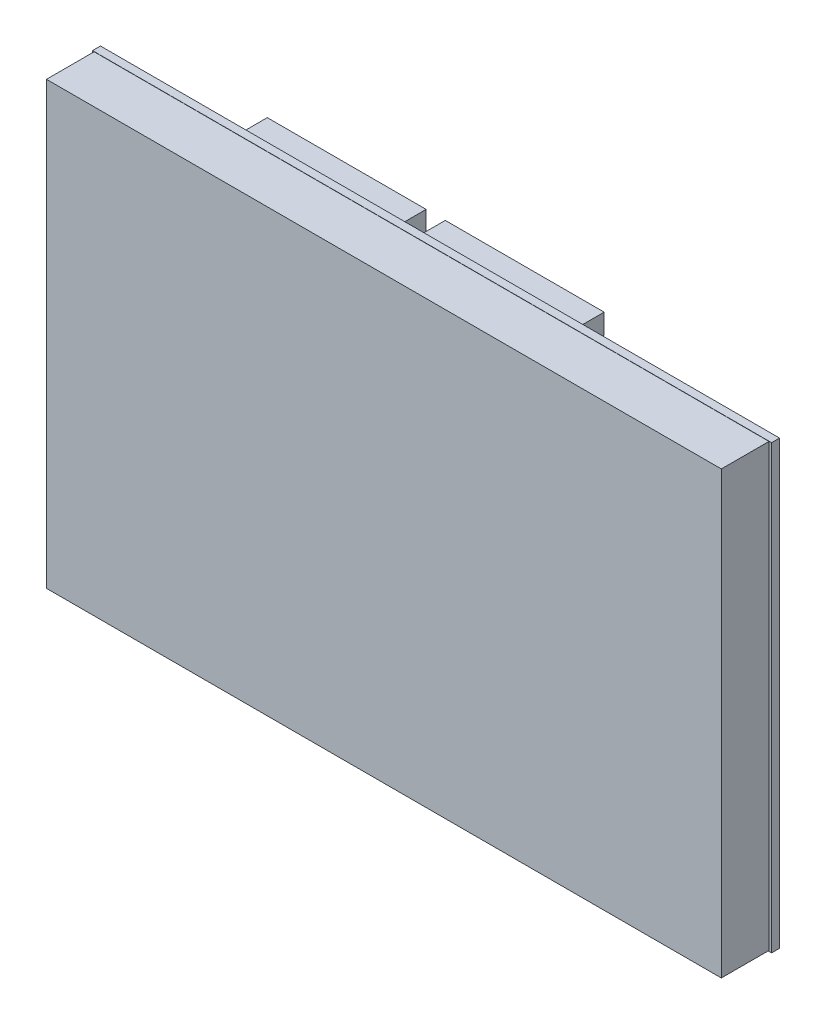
ISO-10303-21;
HEADER;
FILE_DESCRIPTION(('STEP AP214'),'2;1');
FILE_NAME('part.step','',(''),(''),'','','');
FILE_SCHEMA(('AUTOMOTIVE_DESIGN { 1 0 10303 214 1 1 1 1 }'));
ENDSEC;
DATA;
#1=APPLICATION_CONTEXT('core data for automotive mechanical design processes');
#2=APPLICATION_PROTOCOL_DEFINITION('international standard','automotive_design',2000,#1);
#3=PRODUCT_CONTEXT('',#1,'mechanical');
#4=PRODUCT('Part','Part','',(#3));
#5=PRODUCT_RELATED_PRODUCT_CATEGORY('part','',(#4));
#6=PRODUCT_DEFINITION_FORMATION('','',#4);
#7=PRODUCT_DEFINITION_CONTEXT('part definition',#1,'design');
#8=PRODUCT_DEFINITION('design','',#6,#7);
#9=PRODUCT_DEFINITION_SHAPE('','',#8);
#10=(LENGTH_UNIT() NAMED_UNIT(*) SI_UNIT(.MILLI.,.METRE.));
#11=(NAMED_UNIT(*) PLANE_ANGLE_UNIT() SI_UNIT($,.RADIAN.));
#12=(NAMED_UNIT(*) SI_UNIT($,.STERADIAN.) SOLID_ANGLE_UNIT());
#13=UNCERTAINTY_MEASURE_WITH_UNIT(LENGTH_MEASURE(1.E-05),#10,'distance_accuracy_value','');
#14=(GEOMETRIC_REPRESENTATION_CONTEXT(3) GLOBAL_UNCERTAINTY_ASSIGNED_CONTEXT((#13)) GLOBAL_UNIT_ASSIGNED_CONTEXT((#10,
#11,#12)) REPRESENTATION_CONTEXT('',''));
#15=CARTESIAN_POINT('',(0.,0.,0.));
#16=DIRECTION('',(0.,0.,1.));
#17=DIRECTION('',(1.,0.,0.));
#18=AXIS2_PLACEMENT_3D('',#15,#16,#17);
#19=CARTESIAN_POINT('',(-42.545,27.785,6.));
#20=DIRECTION('',(1.,0.,0.));
#21=DIRECTION('',(0.,1.,0.));
#22=AXIS2_PLACEMENT_3D('',#19,#20,#21);
#23=PLANE('',#22);
#24=DIRECTION('',(0.,-1.,0.));
#25=VECTOR('',#24,1.);
#26=CARTESIAN_POINT('',(-42.545,27.785,0.));
#27=LINE('',#26,#25);
#28=CARTESIAN_POINT('',(-42.545,27.785,0.));
#29=VERTEX_POINT('',#28);
#30=CARTESIAN_POINT('',(-42.5449999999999,-27.715,0.));
#31=VERTEX_POINT('',#30);
#32=EDGE_CURVE('E109',#29,#31,#27,.T.);
#33=ORIENTED_EDGE('',*,*,#32,.T.);
#34=DIRECTION('',(0.,0.,-1.));
#35=VECTOR('',#34,1.);
#36=CARTESIAN_POINT('',(-42.5449999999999,-27.715,6.));
#37=LINE('',#36,#35);
#38=CARTESIAN_POINT('',(-42.5449999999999,-27.715,6.));
#39=VERTEX_POINT('',#38);
#40=EDGE_CURVE('E12',#39,#31,#37,.T.);
#41=ORIENTED_EDGE('',*,*,#40,.F.);
#42=DIRECTION('',(0.,-1.,0.));
#43=VECTOR('',#42,1.);
#44=CARTESIAN_POINT('',(-42.545,27.785,6.));
#45=LINE('',#44,#43);
#46=CARTESIAN_POINT('',(-42.545,27.785,6.));
#47=VERTEX_POINT('',#46);
#48=EDGE_CURVE('E97',#47,#39,#45,.T.);
#49=ORIENTED_EDGE('',*,*,#48,.F.);
#50=DIRECTION('',(0.,0.,-1.));
#51=VECTOR('',#50,1.);
#52=CARTESIAN_POINT('',(-42.545,27.785,6.));
#53=LINE('',#52,#51);
#54=EDGE_CURVE('E105',#47,#29,#53,.T.);
#55=ORIENTED_EDGE('',*,*,#54,.T.);
#56=EDGE_LOOP('',(#33,#41,#49,#55));
#57=FACE_BOUND('',#56,.T.);
#58=ADVANCED_FACE('F46',(#57),#23,.F.);
#59=CARTESIAN_POINT('',(-42.5449999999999,-27.715,6.));
#60=DIRECTION('',(0.,1.,0.));
#61=DIRECTION('',(-1.,0.,0.));
#62=AXIS2_PLACEMENT_3D('',#59,#60,#61);
#63=PLANE('',#62);
#64=DIRECTION('',(1.,0.,0.));
#65=VECTOR('',#64,1.);
#66=CARTESIAN_POINT('',(-42.5449999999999,-27.715,0.));
#67=LINE('',#66,#65);
#68=CARTESIAN_POINT('',(42.4150000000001,-27.715,0.));
#69=VERTEX_POINT('',#68);
#70=EDGE_CURVE('E101',#31,#69,#67,.T.);
#71=ORIENTED_EDGE('',*,*,#70,.T.);
#72=DIRECTION('',(0.,0.,-1.));
#73=VECTOR('',#72,1.);
#74=CARTESIAN_POINT('',(42.4150000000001,-27.715,6.));
#75=LINE('',#74,#73);
#76=CARTESIAN_POINT('',(42.4150000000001,-27.715,6.));
#77=VERTEX_POINT('',#76);
#78=EDGE_CURVE('E54',#77,#69,#75,.T.);
#79=ORIENTED_EDGE('',*,*,#78,.F.);
#80=DIRECTION('',(1.,0.,0.));
#81=VECTOR('',#80,1.);
#82=CARTESIAN_POINT('',(-42.5449999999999,-27.715,6.));
#83=LINE('',#82,#81);
#84=EDGE_CURVE('E92',#39,#77,#83,.T.);
#85=ORIENTED_EDGE('',*,*,#84,.F.);
#86=ORIENTED_EDGE('',*,*,#40,.T.);
#87=EDGE_LOOP('',(#71,#79,#85,#86));
#88=FACE_BOUND('',#87,.T.);
#89=ADVANCED_FACE('F100',(#88),#63,.F.);
#90=CARTESIAN_POINT('',(42.415,27.785,6.));
#91=DIRECTION('',(-1.,0.,0.));
#92=DIRECTION('',(0.,-1.,0.));
#93=AXIS2_PLACEMENT_3D('',#90,#91,#92);
#94=PLANE('',#93);
#95=DIRECTION('',(0.,1.,0.));
#96=VECTOR('',#95,1.);
#97=CARTESIAN_POINT('',(42.415,27.785,0.));
#98=LINE('',#97,#96);
#99=CARTESIAN_POINT('',(42.415,27.785,0.));
#100=VERTEX_POINT('',#99);
#101=EDGE_CURVE('E79',#69,#100,#98,.T.);
#102=ORIENTED_EDGE('',*,*,#101,.T.);
#103=DIRECTION('',(0.,0.,-1.));
#104=VECTOR('',#103,1.);
#105=CARTESIAN_POINT('',(42.415,27.785,6.));
#106=LINE('',#105,#104);
#107=CARTESIAN_POINT('',(42.415,27.785,6.));
#108=VERTEX_POINT('',#107);
#109=EDGE_CURVE('E102',#108,#100,#106,.T.);
#110=ORIENTED_EDGE('',*,*,#109,.F.);
#111=DIRECTION('',(0.,1.,0.));
#112=VECTOR('',#111,1.);
#113=CARTESIAN_POINT('',(42.415,27.785,6.));
#114=LINE('',#113,#112);
#115=EDGE_CURVE('E95',#77,#108,#114,.T.);
#116=ORIENTED_EDGE('',*,*,#115,.F.);
#117=ORIENTED_EDGE('',*,*,#78,.T.);
#118=EDGE_LOOP('',(#102,#110,#116,#117));
#119=FACE_BOUND('',#118,.T.);
#120=ADVANCED_FACE('F103',(#119),#94,.F.);
#121=CARTESIAN_POINT('',(-42.545,27.785,6.));
#122=DIRECTION('',(0.,-1.,0.));
#123=DIRECTION('',(0.,0.,-1.));
#124=AXIS2_PLACEMENT_3D('',#121,#122,#123);
#125=PLANE('',#124);
#126=DIRECTION('',(-1.,0.,0.));
#127=VECTOR('',#126,1.);
#128=CARTESIAN_POINT('',(-42.545,27.785,0.));
#129=LINE('',#128,#127);
#130=EDGE_CURVE('E85',#100,#29,#129,.T.);
#131=ORIENTED_EDGE('',*,*,#130,.T.);
#132=ORIENTED_EDGE('',*,*,#54,.F.);
#133=DIRECTION('',(-1.,0.,0.));
#134=VECTOR('',#133,1.);
#135=CARTESIAN_POINT('',(-42.545,27.785,6.));
#136=LINE('',#135,#134);
#137=EDGE_CURVE('E62',#108,#47,#136,.T.);
#138=ORIENTED_EDGE('',*,*,#137,.F.);
#139=ORIENTED_EDGE('',*,*,#109,.T.);
#140=EDGE_LOOP('',(#131,#132,#138,#139));
#141=FACE_BOUND('',#140,.T.);
#142=ADVANCED_FACE('F116',(#141),#125,.F.);
#143=CARTESIAN_POINT('',(0.,0.,6.));
#144=DIRECTION('',(0.,0.,1.));
#145=DIRECTION('',(1.,0.,0.));
#146=AXIS2_PLACEMENT_3D('',#143,#144,#145);
#147=PLANE('',#146);
#148=ORIENTED_EDGE('',*,*,#48,.T.);
#149=ORIENTED_EDGE('',*,*,#84,.T.);
#150=ORIENTED_EDGE('',*,*,#115,.T.);
#151=ORIENTED_EDGE('',*,*,#137,.T.);
#152=EDGE_LOOP('',(#148,#149,#150,#151));
#153=FACE_BOUND('',#152,.T.);
#154=ADVANCED_FACE('F93',(#153),#147,.T.);
#155=CARTESIAN_POINT('',(0.,0.,0.));
#156=DIRECTION('',(0.,0.,1.));
#157=DIRECTION('',(1.,0.,0.));
#158=AXIS2_PLACEMENT_3D('',#155,#156,#157);
#159=PLANE('',#158);
#160=ORIENTED_EDGE('',*,*,#32,.F.);
#161=ORIENTED_EDGE('',*,*,#130,.F.);
#162=ORIENTED_EDGE('',*,*,#101,.F.);
#163=ORIENTED_EDGE('',*,*,#70,.F.);
#164=EDGE_LOOP('',(#160,#161,#162,#163));
#165=FACE_BOUND('',#164,.T.);
#166=ADVANCED_FACE('F119',(#165),#159,.F.);
#167=CLOSED_SHELL('',(#58,#89,#120,#142,#154,#166));
#168=MANIFOLD_SOLID_BREP('B2',#167);
#169=CARTESIAN_POINT('',(-12.7449999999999,-10.815,-3.));
#170=DIRECTION('',(-1.,0.,0.));
#171=DIRECTION('',(0.,0.,1.));
#172=AXIS2_PLACEMENT_3D('',#169,#170,#171);
#173=PLANE('',#172);
#174=DIRECTION('',(0.,-1.,0.));
#175=VECTOR('',#174,1.);
#176=CARTESIAN_POINT('',(-12.7449999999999,-10.815,-1.));
#177=LINE('',#176,#175);
#178=CARTESIAN_POINT('',(-12.7449999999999,-10.815,-1.));
#179=VERTEX_POINT('',#178);
#180=CARTESIAN_POINT('',(-12.7449999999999,-15.815,-1.));
#181=VERTEX_POINT('',#180);
#182=EDGE_CURVE('E242',#179,#181,#177,.T.);
#183=ORIENTED_EDGE('',*,*,#182,.T.);
#184=DIRECTION('',(0.,0.,1.));
#185=VECTOR('',#184,1.);
#186=CARTESIAN_POINT('',(-12.7449999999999,-15.815,-3.));
#187=LINE('',#186,#185);
#188=CARTESIAN_POINT('',(-12.7449999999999,-15.815,-3.));
#189=VERTEX_POINT('',#188);
#190=EDGE_CURVE('E44',#189,#181,#187,.T.);
#191=ORIENTED_EDGE('',*,*,#190,.F.);
#192=DIRECTION('',(0.,-1.,0.));
#193=VECTOR('',#192,1.);
#194=CARTESIAN_POINT('',(-12.7449999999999,-10.815,-3.));
#195=LINE('',#194,#193);
#196=CARTESIAN_POINT('',(-12.7449999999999,-10.815,-3.));
#197=VERTEX_POINT('',#196);
#198=EDGE_CURVE('E230',#197,#189,#195,.T.);
#199=ORIENTED_EDGE('',*,*,#198,.F.);
#200=DIRECTION('',(0.,0.,1.));
#201=VECTOR('',#200,1.);
#202=CARTESIAN_POINT('',(-12.7449999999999,-10.815,-3.));
#203=LINE('',#202,#201);
#204=EDGE_CURVE('E238',#197,#179,#203,.T.);
#205=ORIENTED_EDGE('',*,*,#204,.T.);
#206=EDGE_LOOP('',(#183,#191,#199,#205));
#207=FACE_BOUND('',#206,.T.);
#208=ADVANCED_FACE('F179',(#207),#173,.F.);
#209=CARTESIAN_POINT('',(-12.7449999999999,-15.815,-3.));
#210=DIRECTION('',(0.,1.,0.));
#211=DIRECTION('',(-1.,0.,0.));
#212=AXIS2_PLACEMENT_3D('',#209,#210,#211);
#213=PLANE('',#212);
#214=DIRECTION('',(-1.,0.,0.));
#215=VECTOR('',#214,1.);
#216=CARTESIAN_POINT('',(-12.7449999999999,-15.815,-1.));
#217=LINE('',#216,#215);
#218=CARTESIAN_POINT('',(-17.7449999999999,-15.815,-1.));
#219=VERTEX_POINT('',#218);
#220=EDGE_CURVE('E234',#181,#219,#217,.T.);
#221=ORIENTED_EDGE('',*,*,#220,.T.);
#222=DIRECTION('',(0.,0.,1.));
#223=VECTOR('',#222,1.);
#224=CARTESIAN_POINT('',(-17.7449999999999,-15.815,-3.));
#225=LINE('',#224,#223);
#226=CARTESIAN_POINT('',(-17.7449999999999,-15.815,-3.));
#227=VERTEX_POINT('',#226);
#228=EDGE_CURVE('E187',#227,#219,#225,.T.);
#229=ORIENTED_EDGE('',*,*,#228,.F.);
#230=DIRECTION('',(-1.,0.,0.));
#231=VECTOR('',#230,1.);
#232=CARTESIAN_POINT('',(-12.7449999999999,-15.815,-3.));
#233=LINE('',#232,#231);
#234=EDGE_CURVE('E225',#189,#227,#233,.T.);
#235=ORIENTED_EDGE('',*,*,#234,.F.);
#236=ORIENTED_EDGE('',*,*,#190,.T.);
#237=EDGE_LOOP('',(#221,#229,#235,#236));
#238=FACE_BOUND('',#237,.T.);
#239=ADVANCED_FACE('F233',(#238),#213,.F.);
#240=CARTESIAN_POINT('',(-17.7449999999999,-10.815,-3.));
#241=DIRECTION('',(1.,0.,0.));
#242=DIRECTION('',(0.,0.,-1.));
#243=AXIS2_PLACEMENT_3D('',#240,#241,#242);
#244=PLANE('',#243);
#245=DIRECTION('',(0.,1.,0.));
#246=VECTOR('',#245,1.);
#247=CARTESIAN_POINT('',(-17.7449999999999,-10.815,-1.));
#248=LINE('',#247,#246);
#249=CARTESIAN_POINT('',(-17.7449999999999,-10.815,-1.));
#250=VERTEX_POINT('',#249);
#251=EDGE_CURVE('E212',#219,#250,#248,.T.);
#252=ORIENTED_EDGE('',*,*,#251,.T.);
#253=DIRECTION('',(0.,0.,1.));
#254=VECTOR('',#253,1.);
#255=CARTESIAN_POINT('',(-17.7449999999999,-10.815,-3.));
#256=LINE('',#255,#254);
#257=CARTESIAN_POINT('',(-17.7449999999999,-10.815,-3.));
#258=VERTEX_POINT('',#257);
#259=EDGE_CURVE('E235',#258,#250,#256,.T.);
#260=ORIENTED_EDGE('',*,*,#259,.F.);
#261=DIRECTION('',(0.,1.,0.));
#262=VECTOR('',#261,1.);
#263=CARTESIAN_POINT('',(-17.7449999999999,-10.815,-3.));
#264=LINE('',#263,#262);
#265=EDGE_CURVE('E228',#227,#258,#264,.T.);
#266=ORIENTED_EDGE('',*,*,#265,.F.);
#267=ORIENTED_EDGE('',*,*,#228,.T.);
#268=EDGE_LOOP('',(#252,#260,#266,#267));
#269=FACE_BOUND('',#268,.T.);
#270=ADVANCED_FACE('F236',(#269),#244,.F.);
#271=CARTESIAN_POINT('',(-12.7449999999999,-10.815,-3.));
#272=DIRECTION('',(0.,-1.,0.));
#273=DIRECTION('',(0.,0.,-1.));
#274=AXIS2_PLACEMENT_3D('',#271,#272,#273);
#275=PLANE('',#274);
#276=DIRECTION('',(1.,0.,0.));
#277=VECTOR('',#276,1.);
#278=CARTESIAN_POINT('',(-12.7449999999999,-10.815,-1.));
#279=LINE('',#278,#277);
#280=EDGE_CURVE('E218',#250,#179,#279,.T.);
#281=ORIENTED_EDGE('',*,*,#280,.T.);
#282=ORIENTED_EDGE('',*,*,#204,.F.);
#283=DIRECTION('',(1.,0.,0.));
#284=VECTOR('',#283,1.);
#285=CARTESIAN_POINT('',(-12.7449999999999,-10.815,-3.));
#286=LINE('',#285,#284);
#287=EDGE_CURVE('E195',#258,#197,#286,.T.);
#288=ORIENTED_EDGE('',*,*,#287,.F.);
#289=ORIENTED_EDGE('',*,*,#259,.T.);
#290=EDGE_LOOP('',(#281,#282,#288,#289));
#291=FACE_BOUND('',#290,.T.);
#292=ADVANCED_FACE('F249',(#291),#275,.F.);
#293=CARTESIAN_POINT('',(0.,0.,-3.));
#294=DIRECTION('',(0.,0.,-1.));
#295=DIRECTION('',(-1.,0.,0.));
#296=AXIS2_PLACEMENT_3D('',#293,#294,#295);
#297=PLANE('',#296);
#298=ORIENTED_EDGE('',*,*,#198,.T.);
#299=ORIENTED_EDGE('',*,*,#234,.T.);
#300=ORIENTED_EDGE('',*,*,#265,.T.);
#301=ORIENTED_EDGE('',*,*,#287,.T.);
#302=EDGE_LOOP('',(#298,#299,#300,#301));
#303=FACE_BOUND('',#302,.T.);
#304=ADVANCED_FACE('F226',(#303),#297,.T.);
#305=CARTESIAN_POINT('',(0.,0.,-1.));
#306=DIRECTION('',(0.,0.,-1.));
#307=DIRECTION('',(-1.,0.,0.));
#308=AXIS2_PLACEMENT_3D('',#305,#306,#307);
#309=PLANE('',#308);
#310=ORIENTED_EDGE('',*,*,#182,.F.);
#311=ORIENTED_EDGE('',*,*,#280,.F.);
#312=ORIENTED_EDGE('',*,*,#251,.F.);
#313=ORIENTED_EDGE('',*,*,#220,.F.);
#314=EDGE_LOOP('',(#310,#311,#312,#313));
#315=FACE_BOUND('',#314,.T.);
#316=ADVANCED_FACE('F252',(#315),#309,.F.);
#317=CLOSED_SHELL('',(#208,#239,#270,#292,#304,#316));
#318=MANIFOLD_SOLID_BREP('B6',#317);
#319=CARTESIAN_POINT('',(12.745,-5.81500000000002,-3.));
#320=DIRECTION('',(-1.,0.,0.));
#321=DIRECTION('',(0.,-1.,0.));
#322=AXIS2_PLACEMENT_3D('',#319,#320,#321);
#323=PLANE('',#322);
#324=DIRECTION('',(0.,-1.,0.));
#325=VECTOR('',#324,1.);
#326=CARTESIAN_POINT('',(12.745,-5.81500000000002,-1.));
#327=LINE('',#326,#325);
#328=CARTESIAN_POINT('',(12.745,-5.81500000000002,-1.));
#329=VERTEX_POINT('',#328);
#330=CARTESIAN_POINT('',(12.745,-7.81500000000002,-1.));
#331=VERTEX_POINT('',#330);
#332=EDGE_CURVE('E375',#329,#331,#327,.T.);
#333=ORIENTED_EDGE('',*,*,#332,.T.);
#334=DIRECTION('',(0.,0.,1.));
#335=VECTOR('',#334,1.);
#336=CARTESIAN_POINT('',(12.745,-7.81500000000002,-3.));
#337=LINE('',#336,#335);
#338=CARTESIAN_POINT('',(12.745,-7.81500000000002,-3.));
#339=VERTEX_POINT('',#338);
#340=EDGE_CURVE('E177',#339,#331,#337,.T.);
#341=ORIENTED_EDGE('',*,*,#340,.F.);
#342=DIRECTION('',(0.,-1.,0.));
#343=VECTOR('',#342,1.);
#344=CARTESIAN_POINT('',(12.745,-5.81500000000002,-3.));
#345=LINE('',#344,#343);
#346=CARTESIAN_POINT('',(12.745,-5.81500000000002,-3.));
#347=VERTEX_POINT('',#346);
#348=EDGE_CURVE('E363',#347,#339,#345,.T.);
#349=ORIENTED_EDGE('',*,*,#348,.F.);
#350=DIRECTION('',(0.,0.,1.));
#351=VECTOR('',#350,1.);
#352=CARTESIAN_POINT('',(12.745,-5.81500000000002,-3.));
#353=LINE('',#352,#351);
#354=EDGE_CURVE('E371',#347,#329,#353,.T.);
#355=ORIENTED_EDGE('',*,*,#354,.T.);
#356=EDGE_LOOP('',(#333,#341,#349,#355));
#357=FACE_BOUND('',#356,.T.);
#358=ADVANCED_FACE('F312',(#357),#323,.F.);
#359=CARTESIAN_POINT('',(12.745,-7.81500000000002,-3.));
#360=DIRECTION('',(0.,1.,0.));
#361=DIRECTION('',(0.,0.,1.));
#362=AXIS2_PLACEMENT_3D('',#359,#360,#361);
#363=PLANE('',#362);
#364=DIRECTION('',(-1.,0.,0.));
#365=VECTOR('',#364,1.);
#366=CARTESIAN_POINT('',(12.745,-7.81500000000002,-1.));
#367=LINE('',#366,#365);
#368=CARTESIAN_POINT('',(7.74500000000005,-7.81500000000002,-1.));
#369=VERTEX_POINT('',#368);
#370=EDGE_CURVE('E367',#331,#369,#367,.T.);
#371=ORIENTED_EDGE('',*,*,#370,.T.);
#372=DIRECTION('',(0.,0.,1.));
#373=VECTOR('',#372,1.);
#374=CARTESIAN_POINT('',(7.74500000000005,-7.81500000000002,-3.));
#375=LINE('',#374,#373);
#376=CARTESIAN_POINT('',(7.74500000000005,-7.81500000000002,-3.));
#377=VERTEX_POINT('',#376);
#378=EDGE_CURVE('E320',#377,#369,#375,.T.);
#379=ORIENTED_EDGE('',*,*,#378,.F.);
#380=DIRECTION('',(-1.,0.,0.));
#381=VECTOR('',#380,1.);
#382=CARTESIAN_POINT('',(12.745,-7.81500000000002,-3.));
#383=LINE('',#382,#381);
#384=EDGE_CURVE('E358',#339,#377,#383,.T.);
#385=ORIENTED_EDGE('',*,*,#384,.F.);
#386=ORIENTED_EDGE('',*,*,#340,.T.);
#387=EDGE_LOOP('',(#371,#379,#385,#386));
#388=FACE_BOUND('',#387,.T.);
#389=ADVANCED_FACE('F366',(#388),#363,.F.);
#390=CARTESIAN_POINT('',(7.74500000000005,-5.81500000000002,-3.));
#391=DIRECTION('',(1.,0.,0.));
#392=DIRECTION('',(0.,0.,-1.));
#393=AXIS2_PLACEMENT_3D('',#390,#391,#392);
#394=PLANE('',#393);
#395=DIRECTION('',(0.,1.,0.));
#396=VECTOR('',#395,1.);
#397=CARTESIAN_POINT('',(7.74500000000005,-5.81500000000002,-1.));
#398=LINE('',#397,#396);
#399=CARTESIAN_POINT('',(7.74500000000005,-5.81500000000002,-1.));
#400=VERTEX_POINT('',#399);
#401=EDGE_CURVE('E345',#369,#400,#398,.T.);
#402=ORIENTED_EDGE('',*,*,#401,.T.);
#403=DIRECTION('',(0.,0.,1.));
#404=VECTOR('',#403,1.);
#405=CARTESIAN_POINT('',(7.74500000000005,-5.81500000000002,-3.));
#406=LINE('',#405,#404);
#407=CARTESIAN_POINT('',(7.74500000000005,-5.81500000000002,-3.));
#408=VERTEX_POINT('',#407);
#409=EDGE_CURVE('E368',#408,#400,#406,.T.);
#410=ORIENTED_EDGE('',*,*,#409,.F.);
#411=DIRECTION('',(0.,1.,0.));
#412=VECTOR('',#411,1.);
#413=CARTESIAN_POINT('',(7.74500000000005,-5.81500000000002,-3.));
#414=LINE('',#413,#412);
#415=EDGE_CURVE('E361',#377,#408,#414,.T.);
#416=ORIENTED_EDGE('',*,*,#415,.F.);
#417=ORIENTED_EDGE('',*,*,#378,.T.);
#418=EDGE_LOOP('',(#402,#410,#416,#417));
#419=FACE_BOUND('',#418,.T.);
#420=ADVANCED_FACE('F369',(#419),#394,.F.);
#421=CARTESIAN_POINT('',(12.745,-5.81500000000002,-3.));
#422=DIRECTION('',(0.,-1.,0.));
#423=DIRECTION('',(0.,0.,-1.));
#424=AXIS2_PLACEMENT_3D('',#421,#422,#423);
#425=PLANE('',#424);
#426=DIRECTION('',(1.,0.,0.));
#427=VECTOR('',#426,1.);
#428=CARTESIAN_POINT('',(12.745,-5.81500000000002,-1.));
#429=LINE('',#428,#427);
#430=EDGE_CURVE('E351',#400,#329,#429,.T.);
#431=ORIENTED_EDGE('',*,*,#430,.T.);
#432=ORIENTED_EDGE('',*,*,#354,.F.);
#433=DIRECTION('',(1.,0.,0.));
#434=VECTOR('',#433,1.);
#435=CARTESIAN_POINT('',(12.745,-5.81500000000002,-3.));
#436=LINE('',#435,#434);
#437=EDGE_CURVE('E328',#408,#347,#436,.T.);
#438=ORIENTED_EDGE('',*,*,#437,.F.);
#439=ORIENTED_EDGE('',*,*,#409,.T.);
#440=EDGE_LOOP('',(#431,#432,#438,#439));
#441=FACE_BOUND('',#440,.T.);
#442=ADVANCED_FACE('F382',(#441),#425,.F.);
#443=CARTESIAN_POINT('',(0.,0.,-3.));
#444=DIRECTION('',(0.,0.,-1.));
#445=DIRECTION('',(-1.,0.,0.));
#446=AXIS2_PLACEMENT_3D('',#443,#444,#445);
#447=PLANE('',#446);
#448=ORIENTED_EDGE('',*,*,#348,.T.);
#449=ORIENTED_EDGE('',*,*,#384,.T.);
#450=ORIENTED_EDGE('',*,*,#415,.T.);
#451=ORIENTED_EDGE('',*,*,#437,.T.);
#452=EDGE_LOOP('',(#448,#449,#450,#451));
#453=FACE_BOUND('',#452,.T.);
#454=ADVANCED_FACE('F359',(#453),#447,.T.);
#455=CARTESIAN_POINT('',(0.,0.,-1.));
#456=DIRECTION('',(0.,0.,-1.));
#457=DIRECTION('',(-1.,0.,0.));
#458=AXIS2_PLACEMENT_3D('',#455,#456,#457);
#459=PLANE('',#458);
#460=ORIENTED_EDGE('',*,*,#332,.F.);
#461=ORIENTED_EDGE('',*,*,#430,.F.);
#462=ORIENTED_EDGE('',*,*,#401,.F.);
#463=ORIENTED_EDGE('',*,*,#370,.F.);
#464=EDGE_LOOP('',(#460,#461,#462,#463));
#465=FACE_BOUND('',#464,.T.);
#466=ADVANCED_FACE('F385',(#465),#459,.F.);
#467=CLOSED_SHELL('',(#358,#389,#420,#442,#454,#466));
#468=MANIFOLD_SOLID_BREP('B38',#467);
#469=CARTESIAN_POINT('',(27.745,5.18499999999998,-3.));
#470=DIRECTION('',(-1.,0.,0.));
#471=DIRECTION('',(0.,0.,1.));
#472=AXIS2_PLACEMENT_3D('',#469,#470,#471);
#473=PLANE('',#472);
#474=DIRECTION('',(0.,-1.,0.));
#475=VECTOR('',#474,1.);
#476=CARTESIAN_POINT('',(27.745,5.18499999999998,-1.));
#477=LINE('',#476,#475);
#478=CARTESIAN_POINT('',(27.745,5.18499999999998,-1.));
#479=VERTEX_POINT('',#478);
#480=CARTESIAN_POINT('',(27.745,-2.81500000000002,-1.));
#481=VERTEX_POINT('',#480);
#482=EDGE_CURVE('E508',#479,#481,#477,.T.);
#483=ORIENTED_EDGE('',*,*,#482,.T.);
#484=DIRECTION('',(0.,0.,1.));
#485=VECTOR('',#484,1.);
#486=CARTESIAN_POINT('',(27.745,-2.81500000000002,-3.));
#487=LINE('',#486,#485);
#488=CARTESIAN_POINT('',(27.745,-2.81500000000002,-3.));
#489=VERTEX_POINT('',#488);
#490=EDGE_CURVE('E310',#489,#481,#487,.T.);
#491=ORIENTED_EDGE('',*,*,#490,.F.);
#492=DIRECTION('',(0.,-1.,0.));
#493=VECTOR('',#492,1.);
#494=CARTESIAN_POINT('',(27.745,5.18499999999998,-3.));
#495=LINE('',#494,#493);
#496=CARTESIAN_POINT('',(27.745,5.18499999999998,-3.));
#497=VERTEX_POINT('',#496);
#498=EDGE_CURVE('E496',#497,#489,#495,.T.);
#499=ORIENTED_EDGE('',*,*,#498,.F.);
#500=DIRECTION('',(0.,0.,1.));
#501=VECTOR('',#500,1.);
#502=CARTESIAN_POINT('',(27.745,5.18499999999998,-3.));
#503=LINE('',#502,#501);
#504=EDGE_CURVE('E504',#497,#479,#503,.T.);
#505=ORIENTED_EDGE('',*,*,#504,.T.);
#506=EDGE_LOOP('',(#483,#491,#499,#505));
#507=FACE_BOUND('',#506,.T.);
#508=ADVANCED_FACE('F445',(#507),#473,.F.);
#509=CARTESIAN_POINT('',(27.745,-2.81500000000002,-3.));
#510=DIRECTION('',(0.,1.,0.));
#511=DIRECTION('',(0.,0.,1.));
#512=AXIS2_PLACEMENT_3D('',#509,#510,#511);
#513=PLANE('',#512);
#514=DIRECTION('',(-1.,0.,0.));
#515=VECTOR('',#514,1.);
#516=CARTESIAN_POINT('',(27.745,-2.81500000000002,-1.));
#517=LINE('',#516,#515);
#518=CARTESIAN_POINT('',(11.745,-2.81500000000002,-1.));
#519=VERTEX_POINT('',#518);
#520=EDGE_CURVE('E500',#481,#519,#517,.T.);
#521=ORIENTED_EDGE('',*,*,#520,.T.);
#522=DIRECTION('',(0.,0.,1.));
#523=VECTOR('',#522,1.);
#524=CARTESIAN_POINT('',(11.745,-2.81500000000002,-3.));
#525=LINE('',#524,#523);
#526=CARTESIAN_POINT('',(11.745,-2.81500000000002,-3.));
#527=VERTEX_POINT('',#526);
#528=EDGE_CURVE('E453',#527,#519,#525,.T.);
#529=ORIENTED_EDGE('',*,*,#528,.F.);
#530=DIRECTION('',(-1.,0.,0.));
#531=VECTOR('',#530,1.);
#532=CARTESIAN_POINT('',(27.745,-2.81500000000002,-3.));
#533=LINE('',#532,#531);
#534=EDGE_CURVE('E491',#489,#527,#533,.T.);
#535=ORIENTED_EDGE('',*,*,#534,.F.);
#536=ORIENTED_EDGE('',*,*,#490,.T.);
#537=EDGE_LOOP('',(#521,#529,#535,#536));
#538=FACE_BOUND('',#537,.T.);
#539=ADVANCED_FACE('F499',(#538),#513,.F.);
#540=CARTESIAN_POINT('',(11.745,5.18499999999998,-3.));
#541=DIRECTION('',(1.,0.,0.));
#542=DIRECTION('',(0.,1.,0.));
#543=AXIS2_PLACEMENT_3D('',#540,#541,#542);
#544=PLANE('',#543);
#545=DIRECTION('',(0.,1.,0.));
#546=VECTOR('',#545,1.);
#547=CARTESIAN_POINT('',(11.745,5.18499999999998,-1.));
#548=LINE('',#547,#546);
#549=CARTESIAN_POINT('',(11.745,5.18499999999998,-1.));
#550=VERTEX_POINT('',#549);
#551=EDGE_CURVE('E478',#519,#550,#548,.T.);
#552=ORIENTED_EDGE('',*,*,#551,.T.);
#553=DIRECTION('',(0.,0.,1.));
#554=VECTOR('',#553,1.);
#555=CARTESIAN_POINT('',(11.745,5.18499999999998,-3.));
#556=LINE('',#555,#554);
#557=CARTESIAN_POINT('',(11.745,5.18499999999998,-3.));
#558=VERTEX_POINT('',#557);
#559=EDGE_CURVE('E501',#558,#550,#556,.T.);
#560=ORIENTED_EDGE('',*,*,#559,.F.);
#561=DIRECTION('',(0.,1.,0.));
#562=VECTOR('',#561,1.);
#563=CARTESIAN_POINT('',(11.745,5.18499999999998,-3.));
#564=LINE('',#563,#562);
#565=EDGE_CURVE('E494',#527,#558,#564,.T.);
#566=ORIENTED_EDGE('',*,*,#565,.F.);
#567=ORIENTED_EDGE('',*,*,#528,.T.);
#568=EDGE_LOOP('',(#552,#560,#566,#567));
#569=FACE_BOUND('',#568,.T.);
#570=ADVANCED_FACE('F502',(#569),#544,.F.);
#571=CARTESIAN_POINT('',(27.745,5.18499999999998,-3.));
#572=DIRECTION('',(0.,-1.,0.));
#573=DIRECTION('',(0.,0.,-1.));
#574=AXIS2_PLACEMENT_3D('',#571,#572,#573);
#575=PLANE('',#574);
#576=DIRECTION('',(1.,0.,0.));
#577=VECTOR('',#576,1.);
#578=CARTESIAN_POINT('',(27.745,5.18499999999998,-1.));
#579=LINE('',#578,#577);
#580=EDGE_CURVE('E484',#550,#479,#579,.T.);
#581=ORIENTED_EDGE('',*,*,#580,.T.);
#582=ORIENTED_EDGE('',*,*,#504,.F.);
#583=DIRECTION('',(1.,0.,0.));
#584=VECTOR('',#583,1.);
#585=CARTESIAN_POINT('',(27.745,5.18499999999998,-3.));
#586=LINE('',#585,#584);
#587=EDGE_CURVE('E461',#558,#497,#586,.T.);
#588=ORIENTED_EDGE('',*,*,#587,.F.);
#589=ORIENTED_EDGE('',*,*,#559,.T.);
#590=EDGE_LOOP('',(#581,#582,#588,#589));
#591=FACE_BOUND('',#590,.T.);
#592=ADVANCED_FACE('F515',(#591),#575,.F.);
#593=CARTESIAN_POINT('',(0.,0.,-3.));
#594=DIRECTION('',(0.,0.,-1.));
#595=DIRECTION('',(-1.,0.,0.));
#596=AXIS2_PLACEMENT_3D('',#593,#594,#595);
#597=PLANE('',#596);
#598=ORIENTED_EDGE('',*,*,#498,.T.);
#599=ORIENTED_EDGE('',*,*,#534,.T.);
#600=ORIENTED_EDGE('',*,*,#565,.T.);
#601=ORIENTED_EDGE('',*,*,#587,.T.);
#602=EDGE_LOOP('',(#598,#599,#600,#601));
#603=FACE_BOUND('',#602,.T.);
#604=ADVANCED_FACE('F492',(#603),#597,.T.);
#605=CARTESIAN_POINT('',(0.,0.,-1.));
#606=DIRECTION('',(0.,0.,-1.));
#607=DIRECTION('',(-1.,0.,0.));
#608=AXIS2_PLACEMENT_3D('',#605,#606,#607);
#609=PLANE('',#608);
#610=ORIENTED_EDGE('',*,*,#482,.F.);
#611=ORIENTED_EDGE('',*,*,#580,.F.);
#612=ORIENTED_EDGE('',*,*,#551,.F.);
#613=ORIENTED_EDGE('',*,*,#520,.F.);
#614=EDGE_LOOP('',(#610,#611,#612,#613));
#615=FACE_BOUND('',#614,.T.);
#616=ADVANCED_FACE('F518',(#615),#609,.F.);
#617=CLOSED_SHELL('',(#508,#539,#570,#592,#604,#616));
#618=MANIFOLD_SOLID_BREP('B171',#617);
#619=CARTESIAN_POINT('',(-0.244999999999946,-22.815,-6.));
#620=DIRECTION('',(1.,0.,0.));
#621=DIRECTION('',(0.,1.,0.));
#622=AXIS2_PLACEMENT_3D('',#619,#620,#621);
#623=PLANE('',#622);
#624=DIRECTION('',(0.,1.,0.));
#625=VECTOR('',#624,1.);
#626=CARTESIAN_POINT('',(-0.244999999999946,-22.815,-1.));
#627=LINE('',#626,#625);
#628=CARTESIAN_POINT('',(-0.244999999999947,-25.315,-1.));
#629=VERTEX_POINT('',#628);
#630=CARTESIAN_POINT('',(-0.244999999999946,-22.815,-1.));
#631=VERTEX_POINT('',#630);
#632=EDGE_CURVE('E641',#629,#631,#627,.T.);
#633=ORIENTED_EDGE('',*,*,#632,.T.);
#634=DIRECTION('',(0.,0.,1.));
#635=VECTOR('',#634,1.);
#636=CARTESIAN_POINT('',(-0.244999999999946,-22.815,-6.));
#637=LINE('',#636,#635);
#638=CARTESIAN_POINT('',(-0.244999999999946,-22.815,-6.));
#639=VERTEX_POINT('',#638);
#640=EDGE_CURVE('E443',#639,#631,#637,.T.);
#641=ORIENTED_EDGE('',*,*,#640,.F.);
#642=DIRECTION('',(0.,1.,0.));
#643=VECTOR('',#642,1.);
#644=CARTESIAN_POINT('',(-0.244999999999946,-22.815,-6.));
#645=LINE('',#644,#643);
#646=CARTESIAN_POINT('',(-0.244999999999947,-25.315,-6.));
#647=VERTEX_POINT('',#646);
#648=EDGE_CURVE('E629',#647,#639,#645,.T.);
#649=ORIENTED_EDGE('',*,*,#648,.F.);
#650=DIRECTION('',(0.,0.,1.));
#651=VECTOR('',#650,1.);
#652=CARTESIAN_POINT('',(-0.244999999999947,-25.315,-6.));
#653=LINE('',#652,#651);
#654=EDGE_CURVE('E637',#647,#629,#653,.T.);
#655=ORIENTED_EDGE('',*,*,#654,.T.);
#656=EDGE_LOOP('',(#633,#641,#649,#655));
#657=FACE_BOUND('',#656,.T.);
#658=ADVANCED_FACE('F578',(#657),#623,.F.);
#659=CARTESIAN_POINT('',(-0.244999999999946,-22.815,-6.));
#660=DIRECTION('',(0.,-1.,0.));
#661=DIRECTION('',(1.,0.,0.));
#662=AXIS2_PLACEMENT_3D('',#659,#660,#661);
#663=PLANE('',#662);
#664=DIRECTION('',(1.,0.,0.));
#665=VECTOR('',#664,1.);
#666=CARTESIAN_POINT('',(-0.244999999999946,-22.815,-1.));
#667=LINE('',#666,#665);
#668=CARTESIAN_POINT('',(15.7550000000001,-22.815,-1.));
#669=VERTEX_POINT('',#668);
#670=EDGE_CURVE('E633',#631,#669,#667,.T.);
#671=ORIENTED_EDGE('',*,*,#670,.T.);
#672=DIRECTION('',(0.,0.,1.));
#673=VECTOR('',#672,1.);
#674=CARTESIAN_POINT('',(15.7550000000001,-22.815,-6.));
#675=LINE('',#674,#673);
#676=CARTESIAN_POINT('',(15.7550000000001,-22.815,-6.));
#677=VERTEX_POINT('',#676);
#678=EDGE_CURVE('E586',#677,#669,#675,.T.);
#679=ORIENTED_EDGE('',*,*,#678,.F.);
#680=DIRECTION('',(1.,0.,0.));
#681=VECTOR('',#680,1.);
#682=CARTESIAN_POINT('',(-0.244999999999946,-22.815,-6.));
#683=LINE('',#682,#681);
#684=EDGE_CURVE('E624',#639,#677,#683,.T.);
#685=ORIENTED_EDGE('',*,*,#684,.F.);
#686=ORIENTED_EDGE('',*,*,#640,.T.);
#687=EDGE_LOOP('',(#671,#679,#685,#686));
#688=FACE_BOUND('',#687,.T.);
#689=ADVANCED_FACE('F632',(#688),#663,.F.);
#690=CARTESIAN_POINT('',(15.7550000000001,-22.815,-6.));
#691=DIRECTION('',(-1.,0.,0.));
#692=DIRECTION('',(0.,0.,1.));
#693=AXIS2_PLACEMENT_3D('',#690,#691,#692);
#694=PLANE('',#693);
#695=DIRECTION('',(0.,-1.,0.));
#696=VECTOR('',#695,1.);
#697=CARTESIAN_POINT('',(15.7550000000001,-22.815,-1.));
#698=LINE('',#697,#696);
#699=CARTESIAN_POINT('',(15.7550000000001,-25.315,-1.));
#700=VERTEX_POINT('',#699);
#701=EDGE_CURVE('E611',#669,#700,#698,.T.);
#702=ORIENTED_EDGE('',*,*,#701,.T.);
#703=DIRECTION('',(0.,0.,1.));
#704=VECTOR('',#703,1.);
#705=CARTESIAN_POINT('',(15.7550000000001,-25.315,-6.));
#706=LINE('',#705,#704);
#707=CARTESIAN_POINT('',(15.7550000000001,-25.315,-6.));
#708=VERTEX_POINT('',#707);
#709=EDGE_CURVE('E634',#708,#700,#706,.T.);
#710=ORIENTED_EDGE('',*,*,#709,.F.);
#711=DIRECTION('',(0.,-1.,0.));
#712=VECTOR('',#711,1.);
#713=CARTESIAN_POINT('',(15.7550000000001,-22.815,-6.));
#714=LINE('',#713,#712);
#715=EDGE_CURVE('E627',#677,#708,#714,.T.);
#716=ORIENTED_EDGE('',*,*,#715,.F.);
#717=ORIENTED_EDGE('',*,*,#678,.T.);
#718=EDGE_LOOP('',(#702,#710,#716,#717));
#719=FACE_BOUND('',#718,.T.);
#720=ADVANCED_FACE('F635',(#719),#694,.F.);
#721=CARTESIAN_POINT('',(-0.244999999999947,-25.315,-6.));
#722=DIRECTION('',(0.,1.,0.));
#723=DIRECTION('',(-1.,0.,0.));
#724=AXIS2_PLACEMENT_3D('',#721,#722,#723);
#725=PLANE('',#724);
#726=DIRECTION('',(-1.,0.,0.));
#727=VECTOR('',#726,1.);
#728=CARTESIAN_POINT('',(-0.244999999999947,-25.315,-1.));
#729=LINE('',#728,#727);
#730=EDGE_CURVE('E617',#700,#629,#729,.T.);
#731=ORIENTED_EDGE('',*,*,#730,.T.);
#732=ORIENTED_EDGE('',*,*,#654,.F.);
#733=DIRECTION('',(-1.,0.,0.));
#734=VECTOR('',#733,1.);
#735=CARTESIAN_POINT('',(-0.244999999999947,-25.315,-6.));
#736=LINE('',#735,#734);
#737=EDGE_CURVE('E594',#708,#647,#736,.T.);
#738=ORIENTED_EDGE('',*,*,#737,.F.);
#739=ORIENTED_EDGE('',*,*,#709,.T.);
#740=EDGE_LOOP('',(#731,#732,#738,#739));
#741=FACE_BOUND('',#740,.T.);
#742=ADVANCED_FACE('F648',(#741),#725,.F.);
#743=CARTESIAN_POINT('',(0.,0.,-6.));
#744=DIRECTION('',(0.,0.,1.));
#745=DIRECTION('',(1.,0.,0.));
#746=AXIS2_PLACEMENT_3D('',#743,#744,#745);
#747=PLANE('',#746);
#748=ORIENTED_EDGE('',*,*,#648,.T.);
#749=ORIENTED_EDGE('',*,*,#684,.T.);
#750=ORIENTED_EDGE('',*,*,#715,.T.);
#751=ORIENTED_EDGE('',*,*,#737,.T.);
#752=EDGE_LOOP('',(#748,#749,#750,#751));
#753=FACE_BOUND('',#752,.T.);
#754=ADVANCED_FACE('F625',(#753),#747,.F.);
#755=CARTESIAN_POINT('',(0.,0.,-1.));
#756=DIRECTION('',(0.,0.,1.));
#757=DIRECTION('',(1.,0.,0.));
#758=AXIS2_PLACEMENT_3D('',#755,#756,#757);
#759=PLANE('',#758);
#760=ORIENTED_EDGE('',*,*,#632,.F.);
#761=ORIENTED_EDGE('',*,*,#730,.F.);
#762=ORIENTED_EDGE('',*,*,#701,.F.);
#763=ORIENTED_EDGE('',*,*,#670,.F.);
#764=EDGE_LOOP('',(#760,#761,#762,#763));
#765=FACE_BOUND('',#764,.T.);
#766=ADVANCED_FACE('F651',(#765),#759,.T.);
#767=CLOSED_SHELL('',(#658,#689,#720,#742,#754,#766));
#768=MANIFOLD_SOLID_BREP('B304',#767);
#769=CARTESIAN_POINT('',(-17.7449999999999,-22.815,-6.));
#770=DIRECTION('',(1.,0.,0.));
#771=DIRECTION('',(0.,0.,-1.));
#772=AXIS2_PLACEMENT_3D('',#769,#770,#771);
#773=PLANE('',#772);
#774=DIRECTION('',(0.,1.,0.));
#775=VECTOR('',#774,1.);
#776=CARTESIAN_POINT('',(-17.7449999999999,-22.815,-1.));
#777=LINE('',#776,#775);
#778=CARTESIAN_POINT('',(-17.7449999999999,-25.315,-1.));
#779=VERTEX_POINT('',#778);
#780=CARTESIAN_POINT('',(-17.7449999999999,-22.815,-1.));
#781=VERTEX_POINT('',#780);
#782=EDGE_CURVE('E774',#779,#781,#777,.T.);
#783=ORIENTED_EDGE('',*,*,#782,.T.);
#784=DIRECTION('',(0.,0.,1.));
#785=VECTOR('',#784,1.);
#786=CARTESIAN_POINT('',(-17.7449999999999,-22.815,-6.));
#787=LINE('',#786,#785);
#788=CARTESIAN_POINT('',(-17.7449999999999,-22.815,-6.));
#789=VERTEX_POINT('',#788);
#790=EDGE_CURVE('E576',#789,#781,#787,.T.);
#791=ORIENTED_EDGE('',*,*,#790,.F.);
#792=DIRECTION('',(0.,1.,0.));
#793=VECTOR('',#792,1.);
#794=CARTESIAN_POINT('',(-17.7449999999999,-22.815,-6.));
#795=LINE('',#794,#793);
#796=CARTESIAN_POINT('',(-17.7449999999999,-25.315,-6.));
#797=VERTEX_POINT('',#796);
#798=EDGE_CURVE('E762',#797,#789,#795,.T.);
#799=ORIENTED_EDGE('',*,*,#798,.F.);
#800=DIRECTION('',(0.,0.,1.));
#801=VECTOR('',#800,1.);
#802=CARTESIAN_POINT('',(-17.7449999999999,-25.315,-6.));
#803=LINE('',#802,#801);
#804=EDGE_CURVE('E770',#797,#779,#803,.T.);
#805=ORIENTED_EDGE('',*,*,#804,.T.);
#806=EDGE_LOOP('',(#783,#791,#799,#805));
#807=FACE_BOUND('',#806,.T.);
#808=ADVANCED_FACE('F711',(#807),#773,.F.);
#809=CARTESIAN_POINT('',(-17.7449999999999,-22.815,-6.));
#810=DIRECTION('',(0.,-1.,0.));
#811=DIRECTION('',(1.,0.,0.));
#812=AXIS2_PLACEMENT_3D('',#809,#810,#811);
#813=PLANE('',#812);
#814=DIRECTION('',(1.,0.,0.));
#815=VECTOR('',#814,1.);
#816=CARTESIAN_POINT('',(-17.7449999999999,-22.815,-1.));
#817=LINE('',#816,#815);
#818=CARTESIAN_POINT('',(-1.74499999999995,-22.815,-1.));
#819=VERTEX_POINT('',#818);
#820=EDGE_CURVE('E766',#781,#819,#817,.T.);
#821=ORIENTED_EDGE('',*,*,#820,.T.);
#822=DIRECTION('',(0.,0.,1.));
#823=VECTOR('',#822,1.);
#824=CARTESIAN_POINT('',(-1.74499999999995,-22.815,-6.));
#825=LINE('',#824,#823);
#826=CARTESIAN_POINT('',(-1.74499999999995,-22.815,-6.));
#827=VERTEX_POINT('',#826);
#828=EDGE_CURVE('E719',#827,#819,#825,.T.);
#829=ORIENTED_EDGE('',*,*,#828,.F.);
#830=DIRECTION('',(1.,0.,0.));
#831=VECTOR('',#830,1.);
#832=CARTESIAN_POINT('',(-17.7449999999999,-22.815,-6.));
#833=LINE('',#832,#831);
#834=EDGE_CURVE('E757',#789,#827,#833,.T.);
#835=ORIENTED_EDGE('',*,*,#834,.F.);
#836=ORIENTED_EDGE('',*,*,#790,.T.);
#837=EDGE_LOOP('',(#821,#829,#835,#836));
#838=FACE_BOUND('',#837,.T.);
#839=ADVANCED_FACE('F765',(#838),#813,.F.);
#840=CARTESIAN_POINT('',(-1.74499999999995,-22.815,-6.));
#841=DIRECTION('',(-1.,0.,0.));
#842=DIRECTION('',(0.,-1.,0.));
#843=AXIS2_PLACEMENT_3D('',#840,#841,#842);
#844=PLANE('',#843);
#845=DIRECTION('',(0.,-1.,0.));
#846=VECTOR('',#845,1.);
#847=CARTESIAN_POINT('',(-1.74499999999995,-22.815,-1.));
#848=LINE('',#847,#846);
#849=CARTESIAN_POINT('',(-1.74499999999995,-25.315,-1.));
#850=VERTEX_POINT('',#849);
#851=EDGE_CURVE('E744',#819,#850,#848,.T.);
#852=ORIENTED_EDGE('',*,*,#851,.T.);
#853=DIRECTION('',(0.,0.,1.));
#854=VECTOR('',#853,1.);
#855=CARTESIAN_POINT('',(-1.74499999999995,-25.315,-6.));
#856=LINE('',#855,#854);
#857=CARTESIAN_POINT('',(-1.74499999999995,-25.315,-6.));
#858=VERTEX_POINT('',#857);
#859=EDGE_CURVE('E767',#858,#850,#856,.T.);
#860=ORIENTED_EDGE('',*,*,#859,.F.);
#861=DIRECTION('',(0.,-1.,0.));
#862=VECTOR('',#861,1.);
#863=CARTESIAN_POINT('',(-1.74499999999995,-22.815,-6.));
#864=LINE('',#863,#862);
#865=EDGE_CURVE('E760',#827,#858,#864,.T.);
#866=ORIENTED_EDGE('',*,*,#865,.F.);
#867=ORIENTED_EDGE('',*,*,#828,.T.);
#868=EDGE_LOOP('',(#852,#860,#866,#867));
#869=FACE_BOUND('',#868,.T.);
#870=ADVANCED_FACE('F768',(#869),#844,.F.);
#871=CARTESIAN_POINT('',(-17.7449999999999,-25.315,-6.));
#872=DIRECTION('',(0.,1.,0.));
#873=DIRECTION('',(-1.,0.,0.));
#874=AXIS2_PLACEMENT_3D('',#871,#872,#873);
#875=PLANE('',#874);
#876=DIRECTION('',(-1.,0.,0.));
#877=VECTOR('',#876,1.);
#878=CARTESIAN_POINT('',(-17.7449999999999,-25.315,-1.));
#879=LINE('',#878,#877);
#880=EDGE_CURVE('E750',#850,#779,#879,.T.);
#881=ORIENTED_EDGE('',*,*,#880,.T.);
#882=ORIENTED_EDGE('',*,*,#804,.F.);
#883=DIRECTION('',(-1.,0.,0.));
#884=VECTOR('',#883,1.);
#885=CARTESIAN_POINT('',(-17.7449999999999,-25.315,-6.));
#886=LINE('',#885,#884);
#887=EDGE_CURVE('E727',#858,#797,#886,.T.);
#888=ORIENTED_EDGE('',*,*,#887,.F.);
#889=ORIENTED_EDGE('',*,*,#859,.T.);
#890=EDGE_LOOP('',(#881,#882,#888,#889));
#891=FACE_BOUND('',#890,.T.);
#892=ADVANCED_FACE('F781',(#891),#875,.F.);
#893=CARTESIAN_POINT('',(0.,0.,-6.));
#894=DIRECTION('',(0.,0.,1.));
#895=DIRECTION('',(1.,0.,0.));
#896=AXIS2_PLACEMENT_3D('',#893,#894,#895);
#897=PLANE('',#896);
#898=ORIENTED_EDGE('',*,*,#798,.T.);
#899=ORIENTED_EDGE('',*,*,#834,.T.);
#900=ORIENTED_EDGE('',*,*,#865,.T.);
#901=ORIENTED_EDGE('',*,*,#887,.T.);
#902=EDGE_LOOP('',(#898,#899,#900,#901));
#903=FACE_BOUND('',#902,.T.);
#904=ADVANCED_FACE('F758',(#903),#897,.F.);
#905=CARTESIAN_POINT('',(0.,0.,-1.));
#906=DIRECTION('',(0.,0.,1.));
#907=DIRECTION('',(1.,0.,0.));
#908=AXIS2_PLACEMENT_3D('',#905,#906,#907);
#909=PLANE('',#908);
#910=ORIENTED_EDGE('',*,*,#782,.F.);
#911=ORIENTED_EDGE('',*,*,#880,.F.);
#912=ORIENTED_EDGE('',*,*,#851,.F.);
#913=ORIENTED_EDGE('',*,*,#820,.F.);
#914=EDGE_LOOP('',(#910,#911,#912,#913));
#915=FACE_BOUND('',#914,.T.);
#916=ADVANCED_FACE('F784',(#915),#909,.T.);
#917=CLOSED_SHELL('',(#808,#839,#870,#892,#904,#916));
#918=MANIFOLD_SOLID_BREP('B437',#917);
#919=CARTESIAN_POINT('',(-41.7449999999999,-0.815000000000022,-6.));
#920=DIRECTION('',(1.,0.,0.));
#921=DIRECTION('',(0.,0.,-1.));
#922=AXIS2_PLACEMENT_3D('',#919,#920,#921);
#923=PLANE('',#922);
#924=DIRECTION('',(0.,1.,0.));
#925=VECTOR('',#924,1.);
#926=CARTESIAN_POINT('',(-41.7449999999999,-0.815000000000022,-1.));
#927=LINE('',#926,#925);
#928=CARTESIAN_POINT('',(-41.7449999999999,-15.815,-1.));
#929=VERTEX_POINT('',#928);
#930=CARTESIAN_POINT('',(-41.7449999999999,-0.815000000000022,-1.));
#931=VERTEX_POINT('',#930);
#932=EDGE_CURVE('E907',#929,#931,#927,.T.);
#933=ORIENTED_EDGE('',*,*,#932,.T.);
#934=DIRECTION('',(0.,0.,1.));
#935=VECTOR('',#934,1.);
#936=CARTESIAN_POINT('',(-41.7449999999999,-0.815000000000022,-6.));
#937=LINE('',#936,#935);
#938=CARTESIAN_POINT('',(-41.7449999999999,-0.815000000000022,-6.));
#939=VERTEX_POINT('',#938);
#940=EDGE_CURVE('E709',#939,#931,#937,.T.);
#941=ORIENTED_EDGE('',*,*,#940,.F.);
#942=DIRECTION('',(0.,1.,0.));
#943=VECTOR('',#942,1.);
#944=CARTESIAN_POINT('',(-41.7449999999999,-0.815000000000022,-6.));
#945=LINE('',#944,#943);
#946=CARTESIAN_POINT('',(-41.7449999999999,-15.815,-6.));
#947=VERTEX_POINT('',#946);
#948=EDGE_CURVE('E895',#947,#939,#945,.T.);
#949=ORIENTED_EDGE('',*,*,#948,.F.);
#950=DIRECTION('',(0.,0.,1.));
#951=VECTOR('',#950,1.);
#952=CARTESIAN_POINT('',(-41.7449999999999,-15.815,-6.));
#953=LINE('',#952,#951);
#954=EDGE_CURVE('E903',#947,#929,#953,.T.);
#955=ORIENTED_EDGE('',*,*,#954,.T.);
#956=EDGE_LOOP('',(#933,#941,#949,#955));
#957=FACE_BOUND('',#956,.T.);
#958=ADVANCED_FACE('F844',(#957),#923,.F.);
#959=CARTESIAN_POINT('',(-41.7449999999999,-0.815000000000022,-6.));
#960=DIRECTION('',(0.,-1.,0.));
#961=DIRECTION('',(1.,0.,0.));
#962=AXIS2_PLACEMENT_3D('',#959,#960,#961);
#963=PLANE('',#962);
#964=DIRECTION('',(1.,0.,0.));
#965=VECTOR('',#964,1.);
#966=CARTESIAN_POINT('',(-41.7449999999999,-0.815000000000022,-1.));
#967=LINE('',#966,#965);
#968=CARTESIAN_POINT('',(-26.7449999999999,-0.815000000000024,-1.));
#969=VERTEX_POINT('',#968);
#970=EDGE_CURVE('E899',#931,#969,#967,.T.);
#971=ORIENTED_EDGE('',*,*,#970,.T.);
#972=DIRECTION('',(0.,0.,1.));
#973=VECTOR('',#972,1.);
#974=CARTESIAN_POINT('',(-26.7449999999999,-0.815000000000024,-6.));
#975=LINE('',#974,#973);
#976=CARTESIAN_POINT('',(-26.7449999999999,-0.815000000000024,-6.));
#977=VERTEX_POINT('',#976);
#978=EDGE_CURVE('E852',#977,#969,#975,.T.);
#979=ORIENTED_EDGE('',*,*,#978,.F.);
#980=DIRECTION('',(1.,0.,0.));
#981=VECTOR('',#980,1.);
#982=CARTESIAN_POINT('',(-41.7449999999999,-0.815000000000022,-6.));
#983=LINE('',#982,#981);
#984=EDGE_CURVE('E890',#939,#977,#983,.T.);
#985=ORIENTED_EDGE('',*,*,#984,.F.);
#986=ORIENTED_EDGE('',*,*,#940,.T.);
#987=EDGE_LOOP('',(#971,#979,#985,#986));
#988=FACE_BOUND('',#987,.T.);
#989=ADVANCED_FACE('F898',(#988),#963,.F.);
#990=CARTESIAN_POINT('',(-26.7449999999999,-0.815000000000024,-6.));
#991=DIRECTION('',(-1.,0.,0.));
#992=DIRECTION('',(0.,-1.,0.));
#993=AXIS2_PLACEMENT_3D('',#990,#991,#992);
#994=PLANE('',#993);
#995=DIRECTION('',(0.,-1.,0.));
#996=VECTOR('',#995,1.);
#997=CARTESIAN_POINT('',(-26.7449999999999,-0.815000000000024,-1.));
#998=LINE('',#997,#996);
#999=CARTESIAN_POINT('',(-26.745,-15.815,-1.));
#1000=VERTEX_POINT('',#999);
#1001=EDGE_CURVE('E877',#969,#1000,#998,.T.);
#1002=ORIENTED_EDGE('',*,*,#1001,.T.);
#1003=DIRECTION('',(0.,0.,1.));
#1004=VECTOR('',#1003,1.);
#1005=CARTESIAN_POINT('',(-26.745,-15.815,-6.));
#1006=LINE('',#1005,#1004);
#1007=CARTESIAN_POINT('',(-26.745,-15.815,-6.));
#1008=VERTEX_POINT('',#1007);
#1009=EDGE_CURVE('E900',#1008,#1000,#1006,.T.);
#1010=ORIENTED_EDGE('',*,*,#1009,.F.);
#1011=DIRECTION('',(0.,-1.,0.));
#1012=VECTOR('',#1011,1.);
#1013=CARTESIAN_POINT('',(-26.7449999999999,-0.815000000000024,-6.));
#1014=LINE('',#1013,#1012);
#1015=EDGE_CURVE('E893',#977,#1008,#1014,.T.);
#1016=ORIENTED_EDGE('',*,*,#1015,.F.);
#1017=ORIENTED_EDGE('',*,*,#978,.T.);
#1018=EDGE_LOOP('',(#1002,#1010,#1016,#1017));
#1019=FACE_BOUND('',#1018,.T.);
#1020=ADVANCED_FACE('F901',(#1019),#994,.F.);
#1021=CARTESIAN_POINT('',(-41.7449999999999,-15.815,-6.));
#1022=DIRECTION('',(0.,1.,0.));
#1023=DIRECTION('',(-1.,0.,0.));
#1024=AXIS2_PLACEMENT_3D('',#1021,#1022,#1023);
#1025=PLANE('',#1024);
#1026=DIRECTION('',(-1.,0.,0.));
#1027=VECTOR('',#1026,1.);
#1028=CARTESIAN_POINT('',(-41.7449999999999,-15.815,-1.));
#1029=LINE('',#1028,#1027);
#1030=EDGE_CURVE('E883',#1000,#929,#1029,.T.);
#1031=ORIENTED_EDGE('',*,*,#1030,.T.);
#1032=ORIENTED_EDGE('',*,*,#954,.F.);
#1033=DIRECTION('',(-1.,0.,0.));
#1034=VECTOR('',#1033,1.);
#1035=CARTESIAN_POINT('',(-41.7449999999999,-15.815,-6.));
#1036=LINE('',#1035,#1034);
#1037=EDGE_CURVE('E860',#1008,#947,#1036,.T.);
#1038=ORIENTED_EDGE('',*,*,#1037,.F.);
#1039=ORIENTED_EDGE('',*,*,#1009,.T.);
#1040=EDGE_LOOP('',(#1031,#1032,#1038,#1039));
#1041=FACE_BOUND('',#1040,.T.);
#1042=ADVANCED_FACE('F914',(#1041),#1025,.F.);
#1043=CARTESIAN_POINT('',(0.,0.,-6.));
#1044=DIRECTION('',(0.,0.,1.));
#1045=DIRECTION('',(1.,0.,0.));
#1046=AXIS2_PLACEMENT_3D('',#1043,#1044,#1045);
#1047=PLANE('',#1046);
#1048=ORIENTED_EDGE('',*,*,#948,.T.);
#1049=ORIENTED_EDGE('',*,*,#984,.T.);
#1050=ORIENTED_EDGE('',*,*,#1015,.T.);
#1051=ORIENTED_EDGE('',*,*,#1037,.T.);
#1052=EDGE_LOOP('',(#1048,#1049,#1050,#1051));
#1053=FACE_BOUND('',#1052,.T.);
#1054=ADVANCED_FACE('F891',(#1053),#1047,.F.);
#1055=CARTESIAN_POINT('',(0.,0.,-1.));
#1056=DIRECTION('',(0.,0.,1.));
#1057=DIRECTION('',(1.,0.,0.));
#1058=AXIS2_PLACEMENT_3D('',#1055,#1056,#1057);
#1059=PLANE('',#1058);
#1060=ORIENTED_EDGE('',*,*,#932,.F.);
#1061=ORIENTED_EDGE('',*,*,#1030,.F.);
#1062=ORIENTED_EDGE('',*,*,#1001,.F.);
#1063=ORIENTED_EDGE('',*,*,#970,.F.);
#1064=EDGE_LOOP('',(#1060,#1061,#1062,#1063));
#1065=FACE_BOUND('',#1064,.T.);
#1066=ADVANCED_FACE('F917',(#1065),#1059,.T.);
#1067=CLOSED_SHELL('',(#958,#989,#1020,#1042,#1054,#1066));
#1068=MANIFOLD_SOLID_BREP('B570',#1067);
#1069=CARTESIAN_POINT('',(-4.33499999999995,25.505,-6.));
#1070=DIRECTION('',(1.,0.,0.));
#1071=DIRECTION('',(0.,1.,0.));
#1072=AXIS2_PLACEMENT_3D('',#1069,#1070,#1071);
#1073=PLANE('',#1072);
#1074=DIRECTION('',(0.,1.,0.));
#1075=VECTOR('',#1074,1.);
#1076=CARTESIAN_POINT('',(-4.33499999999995,25.505,-1.));
#1077=LINE('',#1076,#1075);
#1078=CARTESIAN_POINT('',(-4.33499999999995,23.005,-1.));
#1079=VERTEX_POINT('',#1078);
#1080=CARTESIAN_POINT('',(-4.33499999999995,25.505,-1.));
#1081=VERTEX_POINT('',#1080);
#1082=EDGE_CURVE('E1040',#1079,#1081,#1077,.T.);
#1083=ORIENTED_EDGE('',*,*,#1082,.T.);
#1084=DIRECTION('',(0.,0.,1.));
#1085=VECTOR('',#1084,1.);
#1086=CARTESIAN_POINT('',(-4.33499999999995,25.505,-6.));
#1087=LINE('',#1086,#1085);
#1088=CARTESIAN_POINT('',(-4.33499999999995,25.505,-6.));
#1089=VERTEX_POINT('',#1088);
#1090=EDGE_CURVE('E842',#1089,#1081,#1087,.T.);
#1091=ORIENTED_EDGE('',*,*,#1090,.F.);
#1092=DIRECTION('',(0.,1.,0.));
#1093=VECTOR('',#1092,1.);
#1094=CARTESIAN_POINT('',(-4.33499999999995,25.505,-6.));
#1095=LINE('',#1094,#1093);
#1096=CARTESIAN_POINT('',(-4.33499999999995,23.005,-6.));
#1097=VERTEX_POINT('',#1096);
#1098=EDGE_CURVE('E1028',#1097,#1089,#1095,.T.);
#1099=ORIENTED_EDGE('',*,*,#1098,.F.);
#1100=DIRECTION('',(0.,0.,1.));
#1101=VECTOR('',#1100,1.);
#1102=CARTESIAN_POINT('',(-4.33499999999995,23.005,-6.));
#1103=LINE('',#1102,#1101);
#1104=EDGE_CURVE('E1036',#1097,#1079,#1103,.T.);
#1105=ORIENTED_EDGE('',*,*,#1104,.T.);
#1106=EDGE_LOOP('',(#1083,#1091,#1099,#1105));
#1107=FACE_BOUND('',#1106,.T.);
#1108=ADVANCED_FACE('F977',(#1107),#1073,.F.);
#1109=CARTESIAN_POINT('',(-4.33499999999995,25.505,-6.));
#1110=DIRECTION('',(0.,-1.,0.));
#1111=DIRECTION('',(1.,0.,0.));
#1112=AXIS2_PLACEMENT_3D('',#1109,#1110,#1111);
#1113=PLANE('',#1112);
#1114=DIRECTION('',(1.,0.,0.));
#1115=VECTOR('',#1114,1.);
#1116=CARTESIAN_POINT('',(-4.33499999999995,25.505,-1.));
#1117=LINE('',#1116,#1115);
#1118=CARTESIAN_POINT('',(15.6650000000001,25.505,-1.));
#1119=VERTEX_POINT('',#1118);
#1120=EDGE_CURVE('E1032',#1081,#1119,#1117,.T.);
#1121=ORIENTED_EDGE('',*,*,#1120,.T.);
#1122=DIRECTION('',(0.,0.,1.));
#1123=VECTOR('',#1122,1.);
#1124=CARTESIAN_POINT('',(15.6650000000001,25.505,-6.));
#1125=LINE('',#1124,#1123);
#1126=CARTESIAN_POINT('',(15.6650000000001,25.505,-6.));
#1127=VERTEX_POINT('',#1126);
#1128=EDGE_CURVE('E985',#1127,#1119,#1125,.T.);
#1129=ORIENTED_EDGE('',*,*,#1128,.F.);
#1130=DIRECTION('',(1.,0.,0.));
#1131=VECTOR('',#1130,1.);
#1132=CARTESIAN_POINT('',(-4.33499999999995,25.505,-6.));
#1133=LINE('',#1132,#1131);
#1134=EDGE_CURVE('E1023',#1089,#1127,#1133,.T.);
#1135=ORIENTED_EDGE('',*,*,#1134,.F.);
#1136=ORIENTED_EDGE('',*,*,#1090,.T.);
#1137=EDGE_LOOP('',(#1121,#1129,#1135,#1136));
#1138=FACE_BOUND('',#1137,.T.);
#1139=ADVANCED_FACE('F1031',(#1138),#1113,.F.);
#1140=CARTESIAN_POINT('',(15.6650000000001,25.505,-6.));
#1141=DIRECTION('',(-1.,0.,0.));
#1142=DIRECTION('',(0.,0.,1.));
#1143=AXIS2_PLACEMENT_3D('',#1140,#1141,#1142);
#1144=PLANE('',#1143);
#1145=DIRECTION('',(0.,-1.,0.));
#1146=VECTOR('',#1145,1.);
#1147=CARTESIAN_POINT('',(15.6650000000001,25.505,-1.));
#1148=LINE('',#1147,#1146);
#1149=CARTESIAN_POINT('',(15.6650000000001,23.005,-1.));
#1150=VERTEX_POINT('',#1149);
#1151=EDGE_CURVE('E1010',#1119,#1150,#1148,.T.);
#1152=ORIENTED_EDGE('',*,*,#1151,.T.);
#1153=DIRECTION('',(0.,0.,1.));
#1154=VECTOR('',#1153,1.);
#1155=CARTESIAN_POINT('',(15.6650000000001,23.005,-6.));
#1156=LINE('',#1155,#1154);
#1157=CARTESIAN_POINT('',(15.6650000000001,23.005,-6.));
#1158=VERTEX_POINT('',#1157);
#1159=EDGE_CURVE('E1033',#1158,#1150,#1156,.T.);
#1160=ORIENTED_EDGE('',*,*,#1159,.F.);
#1161=DIRECTION('',(0.,-1.,0.));
#1162=VECTOR('',#1161,1.);
#1163=CARTESIAN_POINT('',(15.6650000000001,25.505,-6.));
#1164=LINE('',#1163,#1162);
#1165=EDGE_CURVE('E1026',#1127,#1158,#1164,.T.);
#1166=ORIENTED_EDGE('',*,*,#1165,.F.);
#1167=ORIENTED_EDGE('',*,*,#1128,.T.);
#1168=EDGE_LOOP('',(#1152,#1160,#1166,#1167));
#1169=FACE_BOUND('',#1168,.T.);
#1170=ADVANCED_FACE('F1034',(#1169),#1144,.F.);
#1171=CARTESIAN_POINT('',(-4.33499999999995,23.005,-6.));
#1172=DIRECTION('',(0.,1.,0.));
#1173=DIRECTION('',(-1.,0.,0.));
#1174=AXIS2_PLACEMENT_3D('',#1171,#1172,#1173);
#1175=PLANE('',#1174);
#1176=DIRECTION('',(-1.,0.,0.));
#1177=VECTOR('',#1176,1.);
#1178=CARTESIAN_POINT('',(-4.33499999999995,23.005,-1.));
#1179=LINE('',#1178,#1177);
#1180=EDGE_CURVE('E1016',#1150,#1079,#1179,.T.);
#1181=ORIENTED_EDGE('',*,*,#1180,.T.);
#1182=ORIENTED_EDGE('',*,*,#1104,.F.);
#1183=DIRECTION('',(-1.,0.,0.));
#1184=VECTOR('',#1183,1.);
#1185=CARTESIAN_POINT('',(-4.33499999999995,23.005,-6.));
#1186=LINE('',#1185,#1184);
#1187=EDGE_CURVE('E993',#1158,#1097,#1186,.T.);
#1188=ORIENTED_EDGE('',*,*,#1187,.F.);
#1189=ORIENTED_EDGE('',*,*,#1159,.T.);
#1190=EDGE_LOOP('',(#1181,#1182,#1188,#1189));
#1191=FACE_BOUND('',#1190,.T.);
#1192=ADVANCED_FACE('F1047',(#1191),#1175,.F.);
#1193=CARTESIAN_POINT('',(0.,0.,-6.));
#1194=DIRECTION('',(0.,0.,1.));
#1195=DIRECTION('',(1.,0.,0.));
#1196=AXIS2_PLACEMENT_3D('',#1193,#1194,#1195);
#1197=PLANE('',#1196);
#1198=ORIENTED_EDGE('',*,*,#1098,.T.);
#1199=ORIENTED_EDGE('',*,*,#1134,.T.);
#1200=ORIENTED_EDGE('',*,*,#1165,.T.);
#1201=ORIENTED_EDGE('',*,*,#1187,.T.);
#1202=EDGE_LOOP('',(#1198,#1199,#1200,#1201));
#1203=FACE_BOUND('',#1202,.T.);
#1204=ADVANCED_FACE('F1024',(#1203),#1197,.F.);
#1205=CARTESIAN_POINT('',(0.,0.,-1.));
#1206=DIRECTION('',(0.,0.,1.));
#1207=DIRECTION('',(1.,0.,0.));
#1208=AXIS2_PLACEMENT_3D('',#1205,#1206,#1207);
#1209=PLANE('',#1208);
#1210=ORIENTED_EDGE('',*,*,#1082,.F.);
#1211=ORIENTED_EDGE('',*,*,#1180,.F.);
#1212=ORIENTED_EDGE('',*,*,#1151,.F.);
#1213=ORIENTED_EDGE('',*,*,#1120,.F.);
#1214=EDGE_LOOP('',(#1210,#1211,#1212,#1213));
#1215=FACE_BOUND('',#1214,.T.);
#1216=ADVANCED_FACE('F1050',(#1215),#1209,.T.);
#1217=CLOSED_SHELL('',(#1108,#1139,#1170,#1192,#1204,#1216));
#1218=MANIFOLD_SOLID_BREP('B703',#1217);
#1219=CARTESIAN_POINT('',(-26.7449999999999,25.505,-6.));
#1220=DIRECTION('',(1.,0.,0.));
#1221=DIRECTION('',(0.,0.,-1.));
#1222=AXIS2_PLACEMENT_3D('',#1219,#1220,#1221);
#1223=PLANE('',#1222);
#1224=DIRECTION('',(0.,1.,0.));
#1225=VECTOR('',#1224,1.);
#1226=CARTESIAN_POINT('',(-26.7449999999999,25.505,-1.));
#1227=LINE('',#1226,#1225);
#1228=CARTESIAN_POINT('',(-26.7449999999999,23.005,-1.));
#1229=VERTEX_POINT('',#1228);
#1230=CARTESIAN_POINT('',(-26.7449999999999,25.505,-1.));
#1231=VERTEX_POINT('',#1230);
#1232=EDGE_CURVE('E1172',#1229,#1231,#1227,.T.);
#1233=ORIENTED_EDGE('',*,*,#1232,.T.);
#1234=DIRECTION('',(0.,0.,1.));
#1235=VECTOR('',#1234,1.);
#1236=CARTESIAN_POINT('',(-26.7449999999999,25.505,-6.));
#1237=LINE('',#1236,#1235);
#1238=CARTESIAN_POINT('',(-26.7449999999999,25.505,-6.));
#1239=VERTEX_POINT('',#1238);
#1240=EDGE_CURVE('E975',#1239,#1231,#1237,.T.);
#1241=ORIENTED_EDGE('',*,*,#1240,.F.);
#1242=DIRECTION('',(0.,1.,0.));
#1243=VECTOR('',#1242,1.);
#1244=CARTESIAN_POINT('',(-26.7449999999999,25.505,-6.));
#1245=LINE('',#1244,#1243);
#1246=CARTESIAN_POINT('',(-26.7449999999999,23.005,-6.));
#1247=VERTEX_POINT('',#1246);
#1248=EDGE_CURVE('E1160',#1247,#1239,#1245,.T.);
#1249=ORIENTED_EDGE('',*,*,#1248,.F.);
#1250=DIRECTION('',(0.,0.,1.));
#1251=VECTOR('',#1250,1.);
#1252=CARTESIAN_POINT('',(-26.7449999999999,23.005,-6.));
#1253=LINE('',#1252,#1251);
#1254=EDGE_CURVE('E1168',#1247,#1229,#1253,.T.);
#1255=ORIENTED_EDGE('',*,*,#1254,.T.);
#1256=EDGE_LOOP('',(#1233,#1241,#1249,#1255));
#1257=FACE_BOUND('',#1256,.T.);
#1258=ADVANCED_FACE('F1109',(#1257),#1223,.F.);
#1259=CARTESIAN_POINT('',(-26.7449999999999,25.505,-6.));
#1260=DIRECTION('',(0.,-1.,0.));
#1261=DIRECTION('',(1.,0.,0.));
#1262=AXIS2_PLACEMENT_3D('',#1259,#1260,#1261);
#1263=PLANE('',#1262);
#1264=DIRECTION('',(1.,0.,0.));
#1265=VECTOR('',#1264,1.);
#1266=CARTESIAN_POINT('',(-26.7449999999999,25.505,-1.));
#1267=LINE('',#1266,#1265);
#1268=CARTESIAN_POINT('',(-6.74499999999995,25.505,-1.));
#1269=VERTEX_POINT('',#1268);
#1270=EDGE_CURVE('E1164',#1231,#1269,#1267,.T.);
#1271=ORIENTED_EDGE('',*,*,#1270,.T.);
#1272=DIRECTION('',(0.,0.,1.));
#1273=VECTOR('',#1272,1.);
#1274=CARTESIAN_POINT('',(-6.74499999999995,25.505,-6.));
#1275=LINE('',#1274,#1273);
#1276=CARTESIAN_POINT('',(-6.74499999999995,25.505,-6.));
#1277=VERTEX_POINT('',#1276);
#1278=EDGE_CURVE('E1117',#1277,#1269,#1275,.T.);
#1279=ORIENTED_EDGE('',*,*,#1278,.F.);
#1280=DIRECTION('',(1.,0.,0.));
#1281=VECTOR('',#1280,1.);
#1282=CARTESIAN_POINT('',(-26.7449999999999,25.505,-6.));
#1283=LINE('',#1282,#1281);
#1284=EDGE_CURVE('E1155',#1239,#1277,#1283,.T.);
#1285=ORIENTED_EDGE('',*,*,#1284,.F.);
#1286=ORIENTED_EDGE('',*,*,#1240,.T.);
#1287=EDGE_LOOP('',(#1271,#1279,#1285,#1286));
#1288=FACE_BOUND('',#1287,.T.);
#1289=ADVANCED_FACE('F1163',(#1288),#1263,.F.);
#1290=CARTESIAN_POINT('',(-6.74499999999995,25.505,-6.));
#1291=DIRECTION('',(-1.,0.,0.));
#1292=DIRECTION('',(0.,-1.,0.));
#1293=AXIS2_PLACEMENT_3D('',#1290,#1291,#1292);
#1294=PLANE('',#1293);
#1295=DIRECTION('',(0.,-1.,0.));
#1296=VECTOR('',#1295,1.);
#1297=CARTESIAN_POINT('',(-6.74499999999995,25.505,-1.));
#1298=LINE('',#1297,#1296);
#1299=CARTESIAN_POINT('',(-6.74499999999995,23.005,-1.));
#1300=VERTEX_POINT('',#1299);
#1301=EDGE_CURVE('E1142',#1269,#1300,#1298,.T.);
#1302=ORIENTED_EDGE('',*,*,#1301,.T.);
#1303=DIRECTION('',(0.,0.,1.));
#1304=VECTOR('',#1303,1.);
#1305=CARTESIAN_POINT('',(-6.74499999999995,23.005,-6.));
#1306=LINE('',#1305,#1304);
#1307=CARTESIAN_POINT('',(-6.74499999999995,23.005,-6.));
#1308=VERTEX_POINT('',#1307);
#1309=EDGE_CURVE('E1165',#1308,#1300,#1306,.T.);
#1310=ORIENTED_EDGE('',*,*,#1309,.F.);
#1311=DIRECTION('',(0.,-1.,0.));
#1312=VECTOR('',#1311,1.);
#1313=CARTESIAN_POINT('',(-6.74499999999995,25.505,-6.));
#1314=LINE('',#1313,#1312);
#1315=EDGE_CURVE('E1158',#1277,#1308,#1314,.T.);
#1316=ORIENTED_EDGE('',*,*,#1315,.F.);
#1317=ORIENTED_EDGE('',*,*,#1278,.T.);
#1318=EDGE_LOOP('',(#1302,#1310,#1316,#1317));
#1319=FACE_BOUND('',#1318,.T.);
#1320=ADVANCED_FACE('F1166',(#1319),#1294,.F.);
#1321=CARTESIAN_POINT('',(-26.7449999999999,23.005,-6.));
#1322=DIRECTION('',(0.,1.,0.));
#1323=DIRECTION('',(-1.,0.,0.));
#1324=AXIS2_PLACEMENT_3D('',#1321,#1322,#1323);
#1325=PLANE('',#1324);
#1326=DIRECTION('',(-1.,0.,0.));
#1327=VECTOR('',#1326,1.);
#1328=CARTESIAN_POINT('',(-26.7449999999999,23.005,-1.));
#1329=LINE('',#1328,#1327);
#1330=EDGE_CURVE('E1148',#1300,#1229,#1329,.T.);
#1331=ORIENTED_EDGE('',*,*,#1330,.T.);
#1332=ORIENTED_EDGE('',*,*,#1254,.F.);
#1333=DIRECTION('',(-1.,0.,0.));
#1334=VECTOR('',#1333,1.);
#1335=CARTESIAN_POINT('',(-26.7449999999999,23.005,-6.));
#1336=LINE('',#1335,#1334);
#1337=EDGE_CURVE('E1125',#1308,#1247,#1336,.T.);
#1338=ORIENTED_EDGE('',*,*,#1337,.F.);
#1339=ORIENTED_EDGE('',*,*,#1309,.T.);
#1340=EDGE_LOOP('',(#1331,#1332,#1338,#1339));
#1341=FACE_BOUND('',#1340,.T.);
#1342=ADVANCED_FACE('F1179',(#1341),#1325,.F.);
#1343=CARTESIAN_POINT('',(0.,0.,-6.));
#1344=DIRECTION('',(0.,0.,1.));
#1345=DIRECTION('',(1.,0.,0.));
#1346=AXIS2_PLACEMENT_3D('',#1343,#1344,#1345);
#1347=PLANE('',#1346);
#1348=ORIENTED_EDGE('',*,*,#1248,.T.);
#1349=ORIENTED_EDGE('',*,*,#1284,.T.);
#1350=ORIENTED_EDGE('',*,*,#1315,.T.);
#1351=ORIENTED_EDGE('',*,*,#1337,.T.);
#1352=EDGE_LOOP('',(#1348,#1349,#1350,#1351));
#1353=FACE_BOUND('',#1352,.T.);
#1354=ADVANCED_FACE('F1156',(#1353),#1347,.F.);
#1355=CARTESIAN_POINT('',(0.,0.,-1.));
#1356=DIRECTION('',(0.,0.,1.));
#1357=DIRECTION('',(1.,0.,0.));
#1358=AXIS2_PLACEMENT_3D('',#1355,#1356,#1357);
#1359=PLANE('',#1358);
#1360=ORIENTED_EDGE('',*,*,#1232,.F.);
#1361=ORIENTED_EDGE('',*,*,#1330,.F.);
#1362=ORIENTED_EDGE('',*,*,#1301,.F.);
#1363=ORIENTED_EDGE('',*,*,#1270,.F.);
#1364=EDGE_LOOP('',(#1360,#1361,#1362,#1363));
#1365=FACE_BOUND('',#1364,.T.);
#1366=ADVANCED_FACE('F1182',(#1365),#1359,.T.);
#1367=CLOSED_SHELL('',(#1258,#1289,#1320,#1342,#1354,#1366));
#1368=MANIFOLD_SOLID_BREP('B836',#1367);
#1369=CARTESIAN_POINT('',(-42.7449999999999,-27.815,-1.));
#1370=DIRECTION('',(-1.,0.,0.));
#1371=DIRECTION('',(0.,0.,1.));
#1372=AXIS2_PLACEMENT_3D('',#1369,#1370,#1371);
#1373=PLANE('',#1372);
#1374=DIRECTION('',(0.,-1.,0.));
#1375=VECTOR('',#1374,1.);
#1376=CARTESIAN_POINT('',(-42.7449999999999,-27.815,0.));
#1377=LINE('',#1376,#1375);
#1378=CARTESIAN_POINT('',(-42.7449999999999,27.815,0.));
#1379=VERTEX_POINT('',#1378);
#1380=CARTESIAN_POINT('',(-42.7449999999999,-27.815,0.));
#1381=VERTEX_POINT('',#1380);
#1382=EDGE_CURVE('E1297',#1379,#1381,#1377,.T.);
#1383=ORIENTED_EDGE('',*,*,#1382,.F.);
#1384=DIRECTION('',(0.,0.,1.));
#1385=VECTOR('',#1384,1.);
#1386=CARTESIAN_POINT('',(-42.7449999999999,27.815,-1.));
#1387=LINE('',#1386,#1385);
#1388=CARTESIAN_POINT('',(-42.7449999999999,27.815,-1.));
#1389=VERTEX_POINT('',#1388);
#1390=EDGE_CURVE('E1107',#1389,#1379,#1387,.T.);
#1391=ORIENTED_EDGE('',*,*,#1390,.F.);
#1392=DIRECTION('',(0.,-1.,0.));
#1393=VECTOR('',#1392,1.);
#1394=CARTESIAN_POINT('',(-42.7449999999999,-27.815,-1.));
#1395=LINE('',#1394,#1393);
#1396=CARTESIAN_POINT('',(-42.7449999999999,-27.815,-1.));
#1397=VERTEX_POINT('',#1396);
#1398=EDGE_CURVE('E1291',#1389,#1397,#1395,.T.);
#1399=ORIENTED_EDGE('',*,*,#1398,.T.);
#1400=DIRECTION('',(0.,0.,1.));
#1401=VECTOR('',#1400,1.);
#1402=CARTESIAN_POINT('',(-42.7449999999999,-27.815,-1.));
#1403=LINE('',#1402,#1401);
#1404=EDGE_CURVE('E1236',#1397,#1381,#1403,.T.);
#1405=ORIENTED_EDGE('',*,*,#1404,.T.);
#1406=EDGE_LOOP('',(#1383,#1391,#1399,#1405));
#1407=FACE_BOUND('',#1406,.T.);
#1408=ADVANCED_FACE('F1233',(#1407),#1373,.T.);
#1409=CARTESIAN_POINT('',(42.745,27.815,-1.));
#1410=DIRECTION('',(0.,1.,0.));
#1411=DIRECTION('',(0.,0.,1.));
#1412=AXIS2_PLACEMENT_3D('',#1409,#1410,#1411);
#1413=PLANE('',#1412);
#1414=DIRECTION('',(-1.,0.,0.));
#1415=VECTOR('',#1414,1.);
#1416=CARTESIAN_POINT('',(42.745,27.815,0.));
#1417=LINE('',#1416,#1415);
#1418=CARTESIAN_POINT('',(42.745,27.815,0.));
#1419=VERTEX_POINT('',#1418);
#1420=EDGE_CURVE('E1293',#1419,#1379,#1417,.T.);
#1421=ORIENTED_EDGE('',*,*,#1420,.F.);
#1422=DIRECTION('',(0.,0.,1.));
#1423=VECTOR('',#1422,1.);
#1424=CARTESIAN_POINT('',(42.745,27.815,-1.));
#1425=LINE('',#1424,#1423);
#1426=CARTESIAN_POINT('',(42.745,27.815,-1.));
#1427=VERTEX_POINT('',#1426);
#1428=EDGE_CURVE('E1242',#1427,#1419,#1425,.T.);
#1429=ORIENTED_EDGE('',*,*,#1428,.F.);
#1430=DIRECTION('',(-1.,0.,0.));
#1431=VECTOR('',#1430,1.);
#1432=CARTESIAN_POINT('',(42.745,27.815,-1.));
#1433=LINE('',#1432,#1431);
#1434=EDGE_CURVE('E1288',#1427,#1389,#1433,.T.);
#1435=ORIENTED_EDGE('',*,*,#1434,.T.);
#1436=ORIENTED_EDGE('',*,*,#1390,.T.);
#1437=EDGE_LOOP('',(#1421,#1429,#1435,#1436));
#1438=FACE_BOUND('',#1437,.T.);
#1439=ADVANCED_FACE('F1307',(#1438),#1413,.T.);
#1440=CARTESIAN_POINT('',(42.745,-27.815,-1.));
#1441=DIRECTION('',(1.,0.,0.));
#1442=DIRECTION('',(0.,0.,-1.));
#1443=AXIS2_PLACEMENT_3D('',#1440,#1441,#1442);
#1444=PLANE('',#1443);
#1445=DIRECTION('',(0.,1.,0.));
#1446=VECTOR('',#1445,1.);
#1447=CARTESIAN_POINT('',(42.745,-27.815,0.));
#1448=LINE('',#1447,#1446);
#1449=CARTESIAN_POINT('',(42.745,-27.815,0.));
#1450=VERTEX_POINT('',#1449);
#1451=EDGE_CURVE('E1283',#1450,#1419,#1448,.T.);
#1452=ORIENTED_EDGE('',*,*,#1451,.F.);
#1453=DIRECTION('',(0.,0.,1.));
#1454=VECTOR('',#1453,1.);
#1455=CARTESIAN_POINT('',(42.745,-27.815,-1.));
#1456=LINE('',#1455,#1454);
#1457=CARTESIAN_POINT('',(42.745,-27.815,-1.));
#1458=VERTEX_POINT('',#1457);
#1459=EDGE_CURVE('E1278',#1458,#1450,#1456,.T.);
#1460=ORIENTED_EDGE('',*,*,#1459,.F.);
#1461=DIRECTION('',(0.,1.,0.));
#1462=VECTOR('',#1461,1.);
#1463=CARTESIAN_POINT('',(42.745,-27.815,-1.));
#1464=LINE('',#1463,#1462);
#1465=EDGE_CURVE('E1281',#1458,#1427,#1464,.T.);
#1466=ORIENTED_EDGE('',*,*,#1465,.T.);
#1467=ORIENTED_EDGE('',*,*,#1428,.T.);
#1468=EDGE_LOOP('',(#1452,#1460,#1466,#1467));
#1469=FACE_BOUND('',#1468,.T.);
#1470=ADVANCED_FACE('F1280',(#1469),#1444,.T.);
#1471=CARTESIAN_POINT('',(42.745,-27.815,-1.));
#1472=DIRECTION('',(0.,-1.,0.));
#1473=DIRECTION('',(0.,0.,-1.));
#1474=AXIS2_PLACEMENT_3D('',#1471,#1472,#1473);
#1475=PLANE('',#1474);
#1476=DIRECTION('',(1.,0.,0.));
#1477=VECTOR('',#1476,1.);
#1478=CARTESIAN_POINT('',(42.745,-27.815,0.));
#1479=LINE('',#1478,#1477);
#1480=EDGE_CURVE('E1300',#1381,#1450,#1479,.T.);
#1481=ORIENTED_EDGE('',*,*,#1480,.F.);
#1482=ORIENTED_EDGE('',*,*,#1404,.F.);
#1483=DIRECTION('',(1.,0.,0.));
#1484=VECTOR('',#1483,1.);
#1485=CARTESIAN_POINT('',(42.745,-27.815,-1.));
#1486=LINE('',#1485,#1484);
#1487=EDGE_CURVE('E1287',#1397,#1458,#1486,.T.);
#1488=ORIENTED_EDGE('',*,*,#1487,.T.);
#1489=ORIENTED_EDGE('',*,*,#1459,.T.);
#1490=EDGE_LOOP('',(#1481,#1482,#1488,#1489));
#1491=FACE_BOUND('',#1490,.T.);
#1492=ADVANCED_FACE('F1290',(#1491),#1475,.T.);
#1493=CARTESIAN_POINT('',(0.,0.,-1.));
#1494=DIRECTION('',(0.,0.,1.));
#1495=DIRECTION('',(1.,0.,0.));
#1496=AXIS2_PLACEMENT_3D('',#1493,#1494,#1495);
#1497=PLANE('',#1496);
#1498=ORIENTED_EDGE('',*,*,#1398,.F.);
#1499=ORIENTED_EDGE('',*,*,#1434,.F.);
#1500=ORIENTED_EDGE('',*,*,#1465,.F.);
#1501=ORIENTED_EDGE('',*,*,#1487,.F.);
#1502=EDGE_LOOP('',(#1498,#1499,#1500,#1501));
#1503=FACE_BOUND('',#1502,.T.);
#1504=ADVANCED_FACE('F1286',(#1503),#1497,.F.);
#1505=CARTESIAN_POINT('',(0.,0.,0.));
#1506=DIRECTION('',(0.,0.,1.));
#1507=DIRECTION('',(1.,0.,0.));
#1508=AXIS2_PLACEMENT_3D('',#1505,#1506,#1507);
#1509=PLANE('',#1508);
#1510=ORIENTED_EDGE('',*,*,#1382,.T.);
#1511=ORIENTED_EDGE('',*,*,#1480,.T.);
#1512=ORIENTED_EDGE('',*,*,#1451,.T.);
#1513=ORIENTED_EDGE('',*,*,#1420,.T.);
#1514=EDGE_LOOP('',(#1510,#1511,#1512,#1513));
#1515=FACE_BOUND('',#1514,.T.);
#1516=ADVANCED_FACE('F1306',(#1515),#1509,.T.);
#1517=CLOSED_SHELL('',(#1408,#1439,#1470,#1492,#1504,#1516));
#1518=MANIFOLD_SOLID_BREP('B969',#1517);
#1519=ADVANCED_BREP_SHAPE_REPRESENTATION('',(#18,#168,#318,#468,#618,#768,#918,#1068,#1218,
#1368,#1518),#14);
#1520=SHAPE_DEFINITION_REPRESENTATION(#9,#1519);
ENDSEC;
END-ISO-10303-21;
